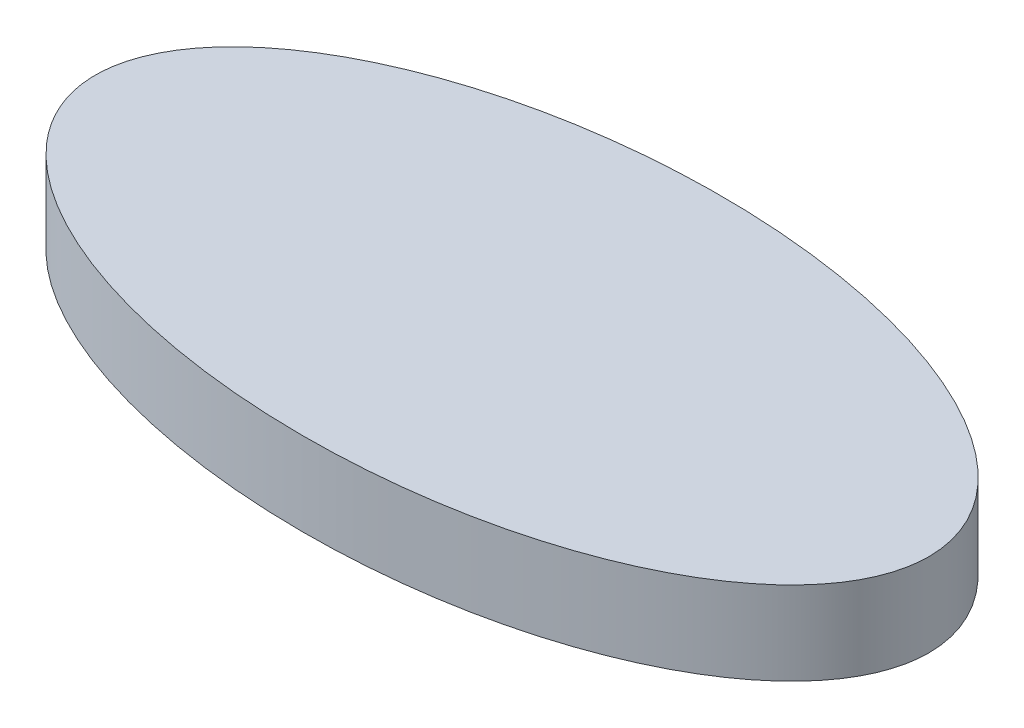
from build123d import *

# Parameters (mm, degrees)
SKETCH1_RX          = 10
SKETCH1_RY          = 5
BOSS_EXTRUDE1_DEPTH = 2


with BuildPart() as part:
    # Sketch1 → Boss-Extrude1 (new body)
    with BuildSketch(Plane(origin=(0, 0, 0), x_dir=(1, 0, 0), z_dir=(0, 1, 0))):
        with Locations((0, 0)):
            Ellipse(SKETCH1_RX, SKETCH1_RY)
    extrude(amount=BOSS_EXTRUDE1_DEPTH)


solid = part.part
